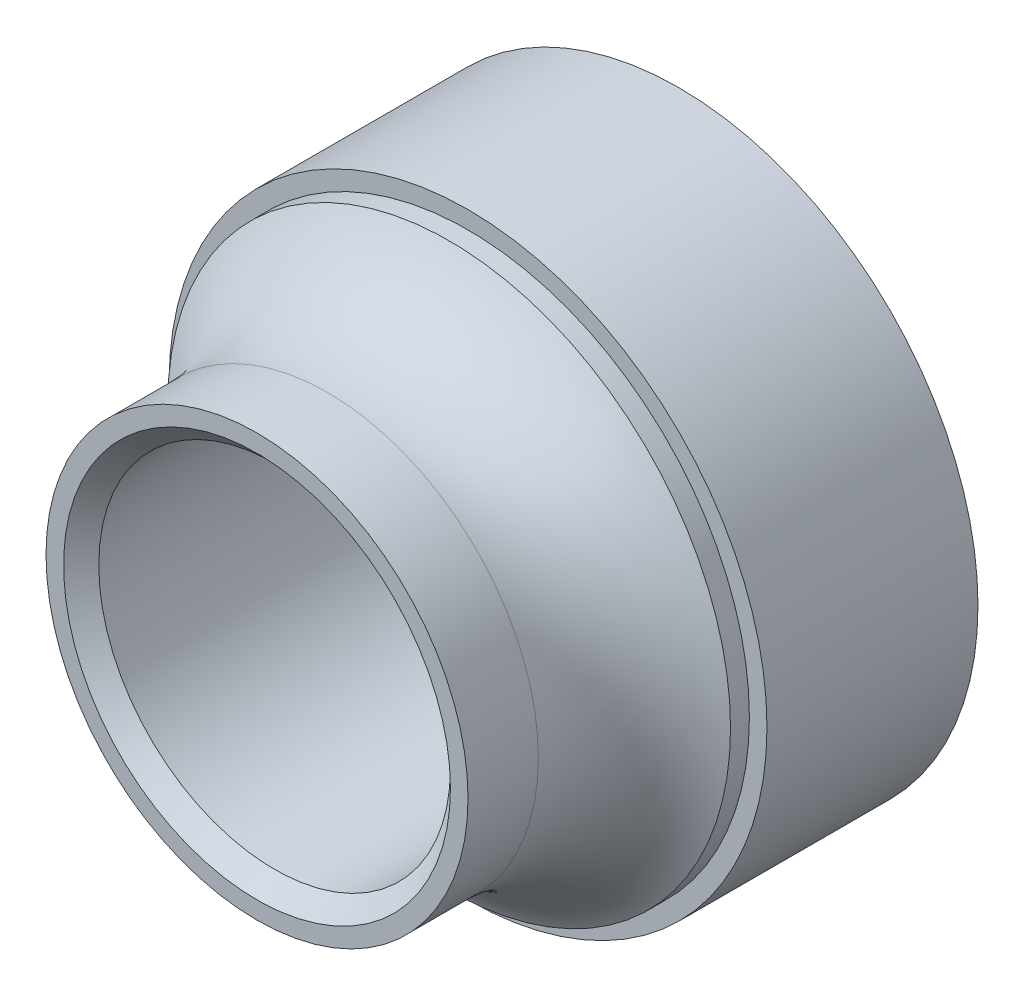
from build123d import *

# Parameters (mm, degrees)
SKETCH_1_R          = 8.5
EXTRUDE_1_DEPTH     = 6
SKETCH_2_R          = 8
EXTRUDE_2_DEPTH     = 6
SKETCH_4_R          = 5
CUT_EXTRUDE_1_DEPTH = 96
CHAMFER_1_SIZE      = 0.5


with BuildPart() as part:
    # Sketch 1 → Extrude 1 (new body)
    with BuildSketch(Plane.XY):
        Circle(SKETCH_1_R)
    extrude(amount=EXTRUDE_1_DEPTH)

    # Sketch 2 → Extrude 2 (add)
    with BuildSketch(Plane.XY.offset(6)):
        Circle(SKETCH_2_R)
    extrude(amount=EXTRUDE_2_DEPTH)

    # Sketch 3 → Cut-Revolve 1 (revolve, cut)
    with BuildSketch(Plane(origin=(0, 0, 0), x_dir=(0, 0, -1), z_dir=(1, 0, 0)), mode=Mode.PRIVATE) as cut_revolve_1_sk:
        with BuildLine():
            Line((-10, 6), (-12, 6))
            Line((-12, 6), (-12, 8))
            Line((-12, 8), (-6.535898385, 8))
            ThreePointArc((-6.535898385, 8), (-8, 6.535898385), (-10, 6))
        make_face()
    revolve(cut_revolve_1_sk.sketch.rotate(Axis((0, 0, 12), (0, 0, -1)), 90), axis=Axis((0, 0, 12), (0, 0, -1)), mode=Mode.SUBTRACT)

    # Sketch 4 → Cut-Extrude 1 (cut)
    with BuildSketch(Plane(origin=(0, 0, 0), x_dir=(-1, 0, 0), z_dir=(0, 0, -1))):
        Circle(SKETCH_4_R)
    extrude(amount=-CUT_EXTRUDE_1_DEPTH, mode=Mode.SUBTRACT)

    # Chamfer 1
    chamfer_1_edges = [part.edges().sort_by_distance(p)[0] for p in [
        (5, 0, 12),
        (5, 0, 0),
    ]]
    chamfer(chamfer_1_edges, length=CHAMFER_1_SIZE)


solid = part.part
